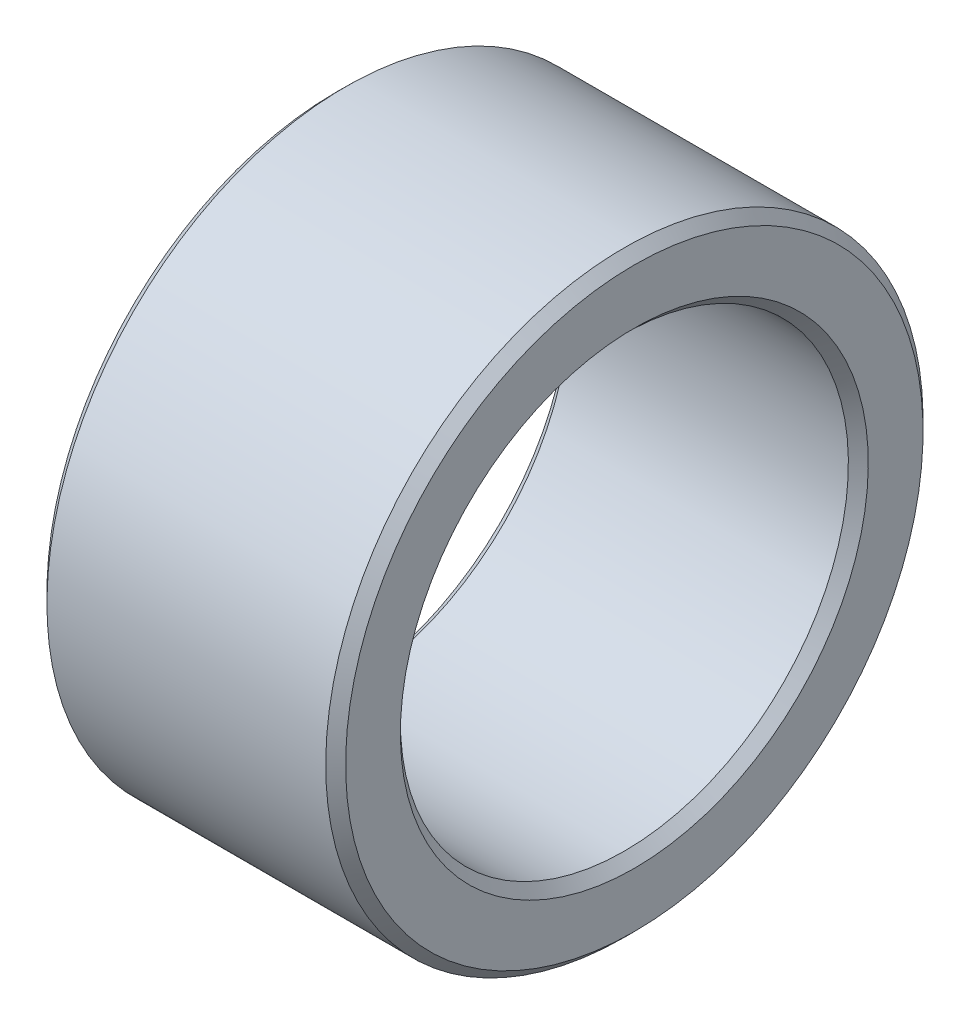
ISO-10303-21;
HEADER;
FILE_DESCRIPTION(('STEP AP214'),'2;1');
FILE_NAME('part.step','',(''),(''),'','','');
FILE_SCHEMA(('AUTOMOTIVE_DESIGN { 1 0 10303 214 1 1 1 1 }'));
ENDSEC;
DATA;
#1=APPLICATION_CONTEXT('core data for automotive mechanical design processes');
#2=APPLICATION_PROTOCOL_DEFINITION('international standard','automotive_design',2000,#1);
#3=PRODUCT_CONTEXT('',#1,'mechanical');
#4=PRODUCT('Part','Part','',(#3));
#5=PRODUCT_RELATED_PRODUCT_CATEGORY('part','',(#4));
#6=PRODUCT_DEFINITION_FORMATION('','',#4);
#7=PRODUCT_DEFINITION_CONTEXT('part definition',#1,'design');
#8=PRODUCT_DEFINITION('design','',#6,#7);
#9=PRODUCT_DEFINITION_SHAPE('','',#8);
#10=(LENGTH_UNIT() NAMED_UNIT(*) SI_UNIT(.MILLI.,.METRE.));
#11=(NAMED_UNIT(*) PLANE_ANGLE_UNIT() SI_UNIT($,.RADIAN.));
#12=(NAMED_UNIT(*) SI_UNIT($,.STERADIAN.) SOLID_ANGLE_UNIT());
#13=UNCERTAINTY_MEASURE_WITH_UNIT(LENGTH_MEASURE(1.E-05),#10,'distance_accuracy_value','');
#14=(GEOMETRIC_REPRESENTATION_CONTEXT(3) GLOBAL_UNCERTAINTY_ASSIGNED_CONTEXT((#13)) GLOBAL_UNIT_ASSIGNED_CONTEXT((#10,
#11,#12)) REPRESENTATION_CONTEXT('',''));
#15=CARTESIAN_POINT('',(0.,0.,0.));
#16=DIRECTION('',(0.,0.,1.));
#17=DIRECTION('',(1.,0.,0.));
#18=AXIS2_PLACEMENT_3D('',#15,#16,#17);
#19=CARTESIAN_POINT('',(0.,-10.5,0.));
#20=DIRECTION('',(-1.,0.,0.));
#21=DIRECTION('',(0.,1.,0.));
#22=AXIS2_PLACEMENT_3D('',#19,#20,#21);
#23=PLANE('',#22);
#24=CARTESIAN_POINT('',(0.,0.,0.));
#25=DIRECTION('',(1.,0.,0.));
#26=DIRECTION('',(0.,-1.,0.));
#27=AXIS2_PLACEMENT_3D('',#24,#25,#26);
#28=CIRCLE('',#27,9.4);
#29=CARTESIAN_POINT('',(0.,-9.4,0.));
#30=VERTEX_POINT('',#29);
#31=EDGE_CURVE('E9',#30,#30,#28,.T.);
#32=ORIENTED_EDGE('',*,*,#31,.T.);
#33=EDGE_LOOP('',(#32));
#34=FACE_BOUND('',#33,.T.);
#35=CARTESIAN_POINT('',(0.,0.,0.));
#36=DIRECTION('',(1.,0.,0.));
#37=DIRECTION('',(0.,-1.,0.));
#38=AXIS2_PLACEMENT_3D('',#35,#36,#37);
#39=CIRCLE('',#38,11.6);
#40=CARTESIAN_POINT('',(0.,-11.6,0.));
#41=VERTEX_POINT('',#40);
#42=EDGE_CURVE('E53',#41,#41,#39,.T.);
#43=ORIENTED_EDGE('',*,*,#42,.F.);
#44=EDGE_LOOP('',(#43));
#45=FACE_BOUND('',#44,.T.);
#46=ADVANCED_FACE('F15',(#34,#45),#23,.T.);
#47=CARTESIAN_POINT('',(0.2,0.,0.));
#48=DIRECTION('',(-1.,0.,0.));
#49=DIRECTION('',(0.,-1.,0.));
#50=AXIS2_PLACEMENT_3D('',#47,#48,#49);
#51=CONICAL_SURFACE('',#50,9.2,0.785398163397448);
#52=CARTESIAN_POINT('',(0.4,0.,0.));
#53=DIRECTION('',(1.,0.,0.));
#54=DIRECTION('',(0.,-1.,0.));
#55=AXIS2_PLACEMENT_3D('',#52,#53,#54);
#56=CIRCLE('',#55,9.);
#57=CARTESIAN_POINT('',(0.4,-9.,0.));
#58=VERTEX_POINT('',#57);
#59=EDGE_CURVE('E22',#58,#58,#56,.T.);
#60=ORIENTED_EDGE('',*,*,#59,.T.);
#61=EDGE_LOOP('',(#60));
#62=FACE_BOUND('',#61,.T.);
#63=ORIENTED_EDGE('',*,*,#31,.F.);
#64=EDGE_LOOP('',(#63));
#65=FACE_BOUND('',#64,.T.);
#66=ADVANCED_FACE('F82',(#62,#65),#51,.F.);
#67=CARTESIAN_POINT('',(6.,0.,0.));
#68=DIRECTION('',(-1.,0.,0.));
#69=DIRECTION('',(0.,-1.,0.));
#70=AXIS2_PLACEMENT_3D('',#67,#68,#69);
#71=CYLINDRICAL_SURFACE('',#70,9.);
#72=CARTESIAN_POINT('',(11.6,0.,0.));
#73=DIRECTION('',(1.,0.,0.));
#74=DIRECTION('',(0.,-1.,0.));
#75=AXIS2_PLACEMENT_3D('',#72,#73,#74);
#76=CIRCLE('',#75,9.);
#77=CARTESIAN_POINT('',(11.6,-9.,0.));
#78=VERTEX_POINT('',#77);
#79=EDGE_CURVE('E58',#78,#78,#76,.T.);
#80=ORIENTED_EDGE('',*,*,#79,.T.);
#81=EDGE_LOOP('',(#80));
#82=FACE_BOUND('',#81,.T.);
#83=ORIENTED_EDGE('',*,*,#59,.F.);
#84=EDGE_LOOP('',(#83));
#85=FACE_BOUND('',#84,.T.);
#86=ADVANCED_FACE('F66',(#82,#85),#71,.F.);
#87=CARTESIAN_POINT('',(11.8,0.,0.));
#88=DIRECTION('',(1.,0.,0.));
#89=DIRECTION('',(0.,-1.,0.));
#90=AXIS2_PLACEMENT_3D('',#87,#88,#89);
#91=CONICAL_SURFACE('',#90,9.2,0.785398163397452);
#92=CARTESIAN_POINT('',(12.,0.,0.));
#93=DIRECTION('',(1.,0.,0.));
#94=DIRECTION('',(0.,-1.,0.));
#95=AXIS2_PLACEMENT_3D('',#92,#93,#94);
#96=CIRCLE('',#95,9.4);
#97=CARTESIAN_POINT('',(12.,-9.4,0.));
#98=VERTEX_POINT('',#97);
#99=EDGE_CURVE('E63',#98,#98,#96,.T.);
#100=ORIENTED_EDGE('',*,*,#99,.T.);
#101=EDGE_LOOP('',(#100));
#102=FACE_BOUND('',#101,.T.);
#103=ORIENTED_EDGE('',*,*,#79,.F.);
#104=EDGE_LOOP('',(#103));
#105=FACE_BOUND('',#104,.T.);
#106=ADVANCED_FACE('F69',(#102,#105),#91,.F.);
#107=CARTESIAN_POINT('',(12.,-10.5,0.));
#108=DIRECTION('',(1.,0.,0.));
#109=DIRECTION('',(0.,-1.,0.));
#110=AXIS2_PLACEMENT_3D('',#107,#108,#109);
#111=PLANE('',#110);
#112=CARTESIAN_POINT('',(12.,0.,0.));
#113=DIRECTION('',(1.,0.,0.));
#114=DIRECTION('',(0.,-1.,0.));
#115=AXIS2_PLACEMENT_3D('',#112,#113,#114);
#116=CIRCLE('',#115,11.6);
#117=CARTESIAN_POINT('',(12.,-11.6,0.));
#118=VERTEX_POINT('',#117);
#119=EDGE_CURVE('E61',#118,#118,#116,.T.);
#120=ORIENTED_EDGE('',*,*,#119,.T.);
#121=EDGE_LOOP('',(#120));
#122=FACE_BOUND('',#121,.T.);
#123=ORIENTED_EDGE('',*,*,#99,.F.);
#124=EDGE_LOOP('',(#123));
#125=FACE_BOUND('',#124,.T.);
#126=ADVANCED_FACE('F71',(#122,#125),#111,.T.);
#127=CARTESIAN_POINT('',(11.8,0.,0.));
#128=DIRECTION('',(-1.,0.,0.));
#129=DIRECTION('',(0.,-1.,0.));
#130=AXIS2_PLACEMENT_3D('',#127,#128,#129);
#131=CONICAL_SURFACE('',#130,11.8,0.785398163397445);
#132=CARTESIAN_POINT('',(11.6,0.,0.));
#133=DIRECTION('',(1.,0.,0.));
#134=DIRECTION('',(0.,-1.,0.));
#135=AXIS2_PLACEMENT_3D('',#132,#133,#134);
#136=CIRCLE('',#135,12.);
#137=CARTESIAN_POINT('',(11.6,-12.,0.));
#138=VERTEX_POINT('',#137);
#139=EDGE_CURVE('E55',#138,#138,#136,.T.);
#140=ORIENTED_EDGE('',*,*,#139,.T.);
#141=EDGE_LOOP('',(#140));
#142=FACE_BOUND('',#141,.T.);
#143=ORIENTED_EDGE('',*,*,#119,.F.);
#144=EDGE_LOOP('',(#143));
#145=FACE_BOUND('',#144,.T.);
#146=ADVANCED_FACE('F79',(#142,#145),#131,.T.);
#147=CARTESIAN_POINT('',(6.,0.,0.));
#148=DIRECTION('',(-1.,0.,0.));
#149=DIRECTION('',(0.,-1.,0.));
#150=AXIS2_PLACEMENT_3D('',#147,#148,#149);
#151=CYLINDRICAL_SURFACE('',#150,12.);
#152=CARTESIAN_POINT('',(0.4,0.,0.));
#153=DIRECTION('',(1.,0.,0.));
#154=DIRECTION('',(0.,-1.,0.));
#155=AXIS2_PLACEMENT_3D('',#152,#153,#154);
#156=CIRCLE('',#155,12.);
#157=CARTESIAN_POINT('',(0.4,-12.,0.));
#158=VERTEX_POINT('',#157);
#159=EDGE_CURVE('E49',#158,#158,#156,.T.);
#160=ORIENTED_EDGE('',*,*,#159,.T.);
#161=EDGE_LOOP('',(#160));
#162=FACE_BOUND('',#161,.T.);
#163=ORIENTED_EDGE('',*,*,#139,.F.);
#164=EDGE_LOOP('',(#163));
#165=FACE_BOUND('',#164,.T.);
#166=ADVANCED_FACE('F50',(#162,#165),#151,.T.);
#167=CARTESIAN_POINT('',(0.2,0.,0.));
#168=DIRECTION('',(1.,0.,0.));
#169=DIRECTION('',(0.,-1.,0.));
#170=AXIS2_PLACEMENT_3D('',#167,#168,#169);
#171=CONICAL_SURFACE('',#170,11.8,0.785398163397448);
#172=ORIENTED_EDGE('',*,*,#42,.T.);
#173=EDGE_LOOP('',(#172));
#174=FACE_BOUND('',#173,.T.);
#175=ORIENTED_EDGE('',*,*,#159,.F.);
#176=EDGE_LOOP('',(#175));
#177=FACE_BOUND('',#176,.T.);
#178=ADVANCED_FACE('F92',(#174,#177),#171,.T.);
#179=CLOSED_SHELL('',(#46,#66,#86,#106,#126,#146,#166,#178));
#180=MANIFOLD_SOLID_BREP('B1',#179);
#181=ADVANCED_BREP_SHAPE_REPRESENTATION('',(#18,#180),#14);
#182=SHAPE_DEFINITION_REPRESENTATION(#9,#181);
ENDSEC;
END-ISO-10303-21;
